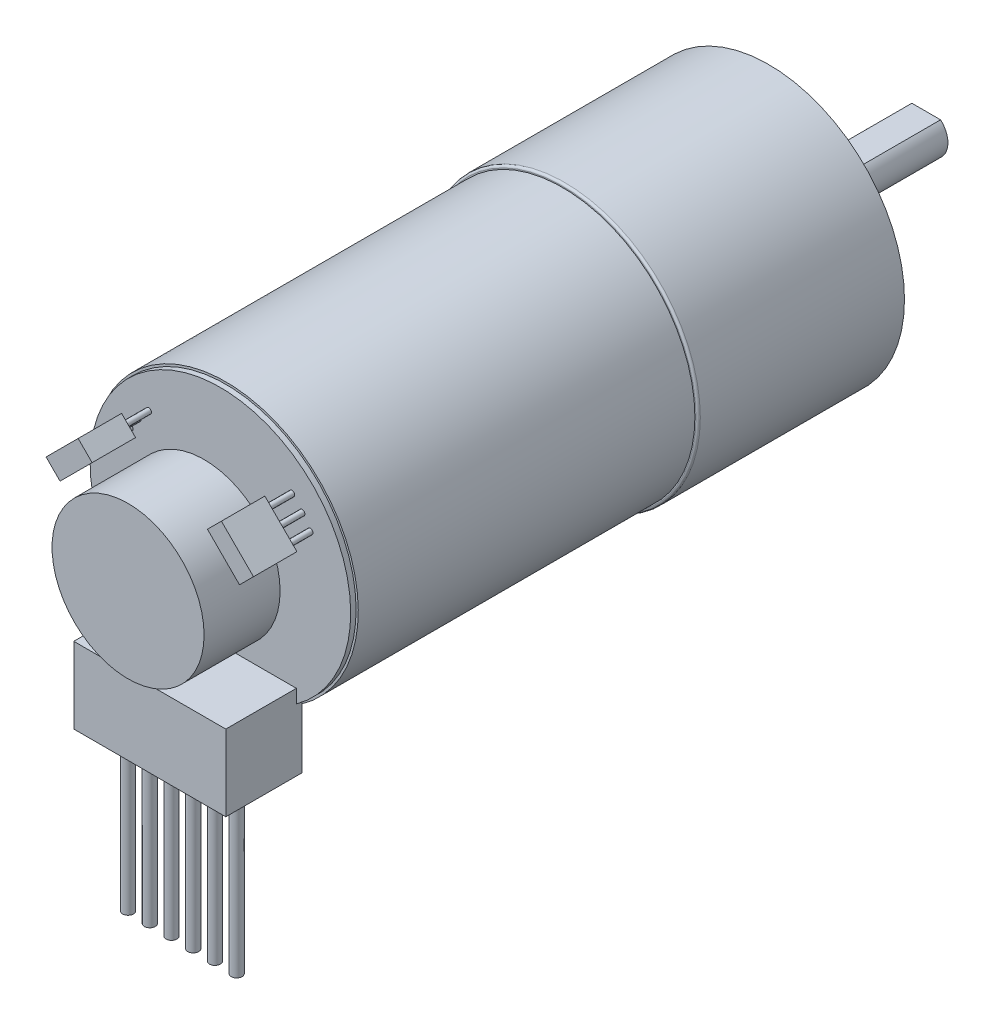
from build123d import *

# Parameters (mm, degrees)
SKETCH_1_R             = 12.5
EXTRUDE_1_DEPTH        = 19
SKETCH_2_R             = 12.2
EXTRUDE_2_DEPTH        = 31
SKETCH_3_R             = 3.5
EXTRUDE_3_DEPTH        = 2.5
SKETCH_4_R             = 2
EXTRUDE_4_DEPTH        = 12
CUT_EXTRUDE_START      = -8
CUT_EXTRUDE_1_DEPTH    = 8
EXTRUDE_START          = 2
SKETCH_6_R             = 2
EXTRUDE_5_DEPTH        = 2
SKETCH_7_R             = 7
EXTRUDE_6_DEPTH        = 7
SKETCH_8_W             = 14
SKETCH_8_H             = 7
EXTRUDE_7_DEPTH        = 7
SKETCH_9_W             = 13
SKETCH_9_H             = 6
SKETCH_9_R             = 0.5
CUT_EXTRUDE_2_DEPTH    = 6
SKETCH_10_R            = 0.25
EXTRUDE_8_DEPTH        = 3
EXTRUDE_9_DEPTH        = 4
EXTRUDE_START_2        = 15
SKETCH_13_R            = 0.5
EXTRUDE_10_DEPTH       = 15
SKETCH_14_R            = 12
EXTRUDE_11_DEPTH       = 0.5
FILLET_1_R             = 0.2
HOLE_WIZARD_M3_1_D     = 2.5
HOLE_WIZARD_M3_1_DEPTH = 8.5
HOLE_WIZARD_M3_1_TIP   = 0.751075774


with BuildPart() as part:
    # Sketch 1 → Extrude 1 (new body)
    with BuildSketch(Plane.XY):
        Circle(SKETCH_1_R)
    extrude(amount=EXTRUDE_1_DEPTH)

    # Sketch 2 → Extrude 2 (add)
    with BuildSketch(Plane.XY.offset(19)):
        Circle(SKETCH_2_R)
    extrude(amount=EXTRUDE_2_DEPTH)

    # Sketch 3 → Extrude 3 (add)
    with BuildSketch(Plane(origin=(0, 0, 0), x_dir=(-1, 0, 0), z_dir=(0, 0, -1))):
        with Locations(Location((0, 0, 0), (0, 0, 180))):
            Circle(SKETCH_3_R)
    extrude(amount=EXTRUDE_3_DEPTH)

    # Sketch 4 → Extrude 4 (add)
    with BuildSketch(Plane(origin=(0, 0, -2.5), x_dir=(-1, 0, 0), z_dir=(0, 0, -1))):
        Circle(SKETCH_4_R)
    extrude(amount=EXTRUDE_4_DEPTH)

    # Sketch 5 → Cut-Extrude 1 (cut)
    with BuildSketch(Plane(origin=(0, 0, -14.5), x_dir=(-1, 0, 0), z_dir=(0, 0, -1)).offset(CUT_EXTRUDE_START)):
        with BuildLine():
            Line((-1.322875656, 1.5), (1.322875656, 1.5))
            ThreePointArc((1.322875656, 1.5), (0, 2), (-1.322875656, 1.5))
        make_face()
    extrude(amount=CUT_EXTRUDE_1_DEPTH, mode=Mode.SUBTRACT)

    # Sketch 6 → Extrude 5 (add)
    with BuildSketch(Plane.XY.offset(50).offset(EXTRUDE_START)):
        with Locations(Location((0, 0, 0), (0, 0, 48.590377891))):
            Circle(SKETCH_6_R)
    extrude(amount=-EXTRUDE_5_DEPTH)

    # Sketch 7 → Extrude 6 (add)
    with BuildSketch(Plane.XY.offset(52)):
        Circle(SKETCH_7_R)
    extrude(amount=EXTRUDE_6_DEPTH)

    # Sketch 8 → Extrude 7 (add)
    with BuildSketch(Plane.XY.offset(50)):
        with Locations((0, -12)):
            Rectangle(SKETCH_8_W, SKETCH_8_H)
    extrude(amount=EXTRUDE_7_DEPTH)

    # Sketch 9 → Cut-Extrude 2 (cut)
    with BuildSketch(Plane.XZ.offset(15.5)):
        with Locations((0, 53.5)):
            Rectangle(SKETCH_9_W, SKETCH_9_H)
        with Locations(Location((-5, 54, 0), (0, 0, 270))):
            Circle(SKETCH_9_R, mode=Mode.SUBTRACT)
        with Locations(Location((-3, 54, 0), (0, 0, 270))):
            Circle(SKETCH_9_R, mode=Mode.SUBTRACT)
        with Locations(Location((-1, 54, 0), (0, 0, 270))):
            Circle(SKETCH_9_R, mode=Mode.SUBTRACT)
        with Locations(Location((1, 54, 0), (0, 0, 270))):
            Circle(SKETCH_9_R, mode=Mode.SUBTRACT)
        with Locations(Location((3, 54, 0), (0, 0, 270))):
            Circle(SKETCH_9_R, mode=Mode.SUBTRACT)
        with Locations(Location((5, 54, 0), (0, 0, 270))):
            Circle(SKETCH_9_R, mode=Mode.SUBTRACT)
    extrude(amount=-CUT_EXTRUDE_2_DEPTH, mode=Mode.SUBTRACT)

    # Sketch 10 → Extrude 8 (add)
    with BuildSketch(Plane.XY.offset(50)):
        with Locations((6.596423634, 6.836460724)):
            Circle(SKETCH_10_R)
        with Locations((7.535489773, 5.785014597)):
            Circle(SKETCH_10_R)
        with Locations((8.281504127, 4.654749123)):
            Circle(SKETCH_10_R)
    extrude_8 = extrude(amount=EXTRUDE_8_DEPTH)

    # Sketch 12 → Extrude 9 (add)
    with BuildSketch(Plane.XY.offset(53)):
        Polygon((6.596423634, 7.878278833), (5.309665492, 6.59152069), (8.263621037, 3.637565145), (9.55037918, 4.924323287), align=None)
    extrude_9 = extrude(amount=EXTRUDE_9_DEPTH)

    # Mirror 1: Extrude 8, Extrude 9 across plane
    add(extrude_8.mirror(Plane(origin=(0, 0, 0), x_dir=(0, 0, 1), z_dir=(1, 0, 0))))
    add(extrude_9.mirror(Plane(origin=(0, 0, 0), x_dir=(0, 0, 1), z_dir=(1, 0, 0))))

    # Sketch 13 → Extrude 10 (add)
    with BuildSketch(Plane.XZ.offset(15.5).offset(EXTRUDE_START_2)):
        with Locations(Location((-5, 54, 0), (0, 0, 270))):
            Circle(SKETCH_13_R)
        with Locations(Location((-3, 54, 0), (0, 0, 270))):
            Circle(SKETCH_13_R)
        with Locations(Location((-1, 54, 0), (0, 0, 270))):
            Circle(SKETCH_13_R)
        with Locations(Location((1, 54, 0), (0, 0, 270))):
            Circle(SKETCH_13_R)
        with Locations(Location((3, 54, 0), (0, 0, 270))):
            Circle(SKETCH_13_R)
        with Locations(Location((5, 54, 0), (0, 0, 270))):
            Circle(SKETCH_13_R)
    extrude(amount=-EXTRUDE_10_DEPTH)

    # Sketch 14 → Extrude 11 (add)
    with BuildSketch(Plane.XY.offset(50)):
        Circle(SKETCH_14_R)
    extrude(amount=EXTRUDE_11_DEPTH)

    # Fillet 1
    fillet_1_edges = [part.edges().sort_by_distance(p)[0] for p in [
        (-12.5, 0, 19),
    ]]
    fillet(fillet_1_edges, radius=FILLET_1_R)

    # Hole Wizard M3 _1
    with Locations(Plane(origin=(0, 0, 0), x_dir=(-1, 0, 0), z_dir=(0, 0, -1))):
        with Locations((0, 8.5), (0, -8.5)):
            Hole(HOLE_WIZARD_M3_1_D / 2, depth=HOLE_WIZARD_M3_1_DEPTH)
            with Locations((0, 0, -(HOLE_WIZARD_M3_1_DEPTH + HOLE_WIZARD_M3_1_TIP / 2))):  # 118° drill point
                Cone(0, HOLE_WIZARD_M3_1_D / 2, HOLE_WIZARD_M3_1_TIP, mode=Mode.SUBTRACT)


solid = part.part
